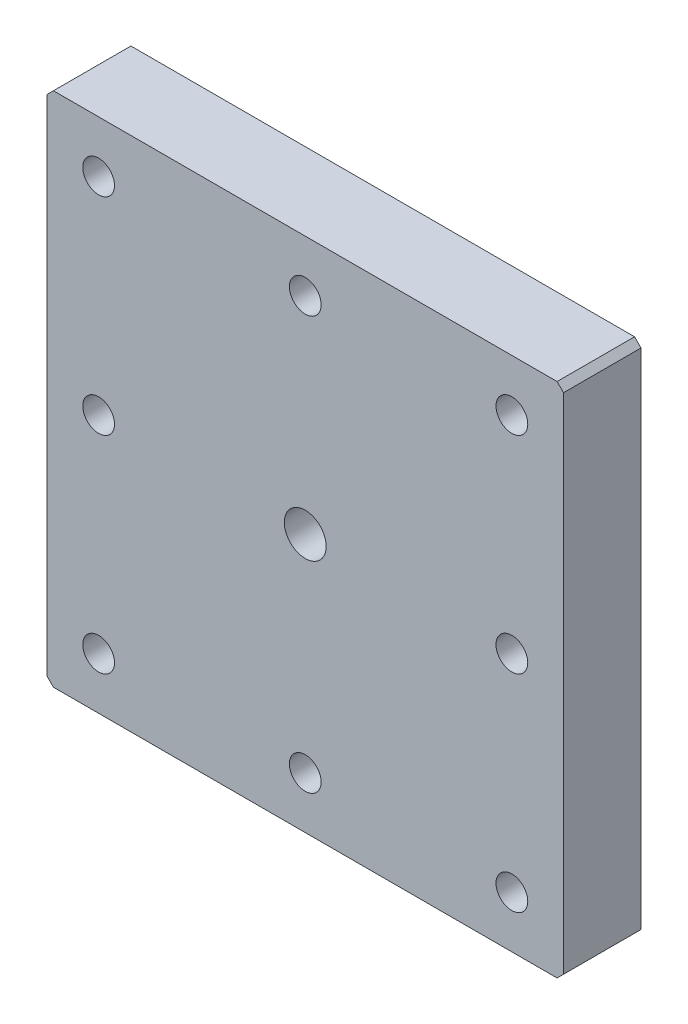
ISO-10303-21;
HEADER;
FILE_DESCRIPTION(('STEP AP214'),'2;1');
FILE_NAME('part.step','',(''),(''),'','','');
FILE_SCHEMA(('AUTOMOTIVE_DESIGN { 1 0 10303 214 1 1 1 1 }'));
ENDSEC;
DATA;
#1=APPLICATION_CONTEXT('core data for automotive mechanical design processes');
#2=APPLICATION_PROTOCOL_DEFINITION('international standard','automotive_design',2000,#1);
#3=PRODUCT_CONTEXT('',#1,'mechanical');
#4=PRODUCT('Part','Part','',(#3));
#5=PRODUCT_RELATED_PRODUCT_CATEGORY('part','',(#4));
#6=PRODUCT_DEFINITION_FORMATION('','',#4);
#7=PRODUCT_DEFINITION_CONTEXT('part definition',#1,'design');
#8=PRODUCT_DEFINITION('design','',#6,#7);
#9=PRODUCT_DEFINITION_SHAPE('','',#8);
#10=(LENGTH_UNIT() NAMED_UNIT(*) SI_UNIT(.MILLI.,.METRE.));
#11=(NAMED_UNIT(*) PLANE_ANGLE_UNIT() SI_UNIT($,.RADIAN.));
#12=(NAMED_UNIT(*) SI_UNIT($,.STERADIAN.) SOLID_ANGLE_UNIT());
#13=UNCERTAINTY_MEASURE_WITH_UNIT(LENGTH_MEASURE(1.E-05),#10,'distance_accuracy_value','');
#14=(GEOMETRIC_REPRESENTATION_CONTEXT(3) GLOBAL_UNCERTAINTY_ASSIGNED_CONTEXT((#13)) GLOBAL_UNIT_ASSIGNED_CONTEXT((#10,
#11,#12)) REPRESENTATION_CONTEXT('',''));
#15=CARTESIAN_POINT('',(0.,0.,0.));
#16=DIRECTION('',(0.,0.,1.));
#17=DIRECTION('',(1.,0.,0.));
#18=AXIS2_PLACEMENT_3D('',#15,#16,#17);
#19=CARTESIAN_POINT('',(20.,20.0000000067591,12.0000000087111));
#20=DIRECTION('',(0.,-1.,0.));
#21=DIRECTION('',(0.,0.,-1.));
#22=AXIS2_PLACEMENT_3D('',#19,#20,#21);
#23=PLANE('',#22);
#24=DIRECTION('',(-1.,0.,0.));
#25=VECTOR('',#24,1.);
#26=CARTESIAN_POINT('',(20.,20.0000000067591,18.0000000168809));
#27=LINE('',#26,#25);
#28=CARTESIAN_POINT('',(19.5,20.0000000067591,18.0000000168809));
#29=VERTEX_POINT('',#28);
#30=CARTESIAN_POINT('',(-19.5,20.0000000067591,18.0000000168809));
#31=VERTEX_POINT('',#30);
#32=EDGE_CURVE('E364',#29,#31,#27,.T.);
#33=ORIENTED_EDGE('',*,*,#32,.F.);
#34=DIRECTION('',(0.,0.,-1.));
#35=VECTOR('',#34,1.);
#36=CARTESIAN_POINT('',(19.5,20.0000000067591,12.0000000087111));
#37=LINE('',#36,#35);
#38=CARTESIAN_POINT('',(19.5,20.0000000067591,12.0000000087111));
#39=VERTEX_POINT('',#38);
#40=EDGE_CURVE('E319',#29,#39,#37,.T.);
#41=ORIENTED_EDGE('',*,*,#40,.T.);
#42=DIRECTION('',(-1.,0.,0.));
#43=VECTOR('',#42,1.);
#44=CARTESIAN_POINT('',(20.,20.0000000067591,12.0000000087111));
#45=LINE('',#44,#43);
#46=CARTESIAN_POINT('',(-19.5,20.0000000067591,12.0000000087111));
#47=VERTEX_POINT('',#46);
#48=EDGE_CURVE('E374',#39,#47,#45,.T.);
#49=ORIENTED_EDGE('',*,*,#48,.T.);
#50=DIRECTION('',(0.,0.,1.));
#51=VECTOR('',#50,1.);
#52=CARTESIAN_POINT('',(-19.5,20.0000000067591,12.0000000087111));
#53=LINE('',#52,#51);
#54=EDGE_CURVE('E317',#47,#31,#53,.T.);
#55=ORIENTED_EDGE('',*,*,#54,.T.);
#56=EDGE_LOOP('',(#33,#41,#49,#55));
#57=FACE_BOUND('',#56,.T.);
#58=ADVANCED_FACE('F16',(#57),#23,.F.);
#59=CARTESIAN_POINT('',(20.,20.0000000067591,18.0000000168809));
#60=DIRECTION('',(0.,0.,-1.));
#61=DIRECTION('',(-1.,0.,0.));
#62=AXIS2_PLACEMENT_3D('',#59,#60,#61);
#63=PLANE('',#62);
#64=CARTESIAN_POINT('',(0.,0.,18.0000000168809));
#65=DIRECTION('',(0.,0.,1.));
#66=DIRECTION('',(1.,0.,0.));
#67=AXIS2_PLACEMENT_3D('',#64,#65,#66);
#68=CIRCLE('',#67,1.621);
#69=CARTESIAN_POINT('',(1.621,0.,18.0000000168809));
#70=VERTEX_POINT('',#69);
#71=EDGE_CURVE('E172',#70,#70,#68,.T.);
#72=ORIENTED_EDGE('',*,*,#71,.F.);
#73=EDGE_LOOP('',(#72));
#74=FACE_BOUND('',#73,.T.);
#75=CARTESIAN_POINT('',(0.,-16.,18.0000000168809));
#76=DIRECTION('',(0.,0.,1.));
#77=DIRECTION('',(1.,0.,0.));
#78=AXIS2_PLACEMENT_3D('',#75,#76,#77);
#79=CIRCLE('',#78,1.2295);
#80=CARTESIAN_POINT('',(1.2295,-16.,18.0000000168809));
#81=VERTEX_POINT('',#80);
#82=EDGE_CURVE('E171',#81,#81,#79,.T.);
#83=ORIENTED_EDGE('',*,*,#82,.F.);
#84=EDGE_LOOP('',(#83));
#85=FACE_BOUND('',#84,.T.);
#86=CARTESIAN_POINT('',(-16.,-16.,18.0000000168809));
#87=DIRECTION('',(0.,0.,1.));
#88=DIRECTION('',(1.,0.,0.));
#89=AXIS2_PLACEMENT_3D('',#86,#87,#88);
#90=CIRCLE('',#89,1.2295);
#91=CARTESIAN_POINT('',(-14.7705,-16.,18.0000000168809));
#92=VERTEX_POINT('',#91);
#93=EDGE_CURVE('E182',#92,#92,#90,.T.);
#94=ORIENTED_EDGE('',*,*,#93,.F.);
#95=EDGE_LOOP('',(#94));
#96=FACE_BOUND('',#95,.T.);
#97=DIRECTION('',(-1.,0.,0.));
#98=VECTOR('',#97,1.);
#99=CARTESIAN_POINT('',(20.,-20.0000000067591,18.0000000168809));
#100=LINE('',#99,#98);
#101=CARTESIAN_POINT('',(19.5,-20.0000000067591,18.0000000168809));
#102=VERTEX_POINT('',#101);
#103=CARTESIAN_POINT('',(-19.5,-20.0000000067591,18.0000000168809));
#104=VERTEX_POINT('',#103);
#105=EDGE_CURVE('E358',#102,#104,#100,.T.);
#106=ORIENTED_EDGE('',*,*,#105,.F.);
#107=DIRECTION('',(0.707106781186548,0.707106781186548,0.));
#108=VECTOR('',#107,1.);
#109=CARTESIAN_POINT('',(20.,-19.5000000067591,18.0000000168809));
#110=LINE('',#109,#108);
#111=CARTESIAN_POINT('',(20.,-19.5000000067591,18.0000000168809));
#112=VERTEX_POINT('',#111);
#113=EDGE_CURVE('E310',#102,#112,#110,.T.);
#114=ORIENTED_EDGE('',*,*,#113,.T.);
#115=DIRECTION('',(0.,-1.,0.));
#116=VECTOR('',#115,1.);
#117=CARTESIAN_POINT('',(20.,20.0000000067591,18.0000000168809));
#118=LINE('',#117,#116);
#119=CARTESIAN_POINT('',(20.,19.5000000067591,18.0000000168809));
#120=VERTEX_POINT('',#119);
#121=EDGE_CURVE('E339',#120,#112,#118,.T.);
#122=ORIENTED_EDGE('',*,*,#121,.F.);
#123=DIRECTION('',(-0.707106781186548,0.707106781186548,0.));
#124=VECTOR('',#123,1.);
#125=CARTESIAN_POINT('',(20.,19.5000000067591,18.0000000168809));
#126=LINE('',#125,#124);
#127=EDGE_CURVE('E39',#120,#29,#126,.T.);
#128=ORIENTED_EDGE('',*,*,#127,.T.);
#129=ORIENTED_EDGE('',*,*,#32,.T.);
#130=DIRECTION('',(0.707106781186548,0.707106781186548,0.));
#131=VECTOR('',#130,1.);
#132=CARTESIAN_POINT('',(-19.5,20.0000000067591,18.0000000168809));
#133=LINE('',#132,#131);
#134=CARTESIAN_POINT('',(-20.,19.5000000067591,18.0000000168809));
#135=VERTEX_POINT('',#134);
#136=EDGE_CURVE('E31',#31,#135,#133,.F.);
#137=ORIENTED_EDGE('',*,*,#136,.T.);
#138=DIRECTION('',(0.,-1.,0.));
#139=VECTOR('',#138,1.);
#140=CARTESIAN_POINT('',(-20.,20.0000000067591,18.0000000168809));
#141=LINE('',#140,#139);
#142=CARTESIAN_POINT('',(-20.,-19.5000000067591,18.0000000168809));
#143=VERTEX_POINT('',#142);
#144=EDGE_CURVE('E328',#135,#143,#141,.T.);
#145=ORIENTED_EDGE('',*,*,#144,.T.);
#146=DIRECTION('',(-0.707106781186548,0.707106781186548,0.));
#147=VECTOR('',#146,1.);
#148=CARTESIAN_POINT('',(-19.5,-20.0000000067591,18.0000000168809));
#149=LINE('',#148,#147);
#150=EDGE_CURVE('E303',#143,#104,#149,.F.);
#151=ORIENTED_EDGE('',*,*,#150,.T.);
#152=EDGE_LOOP('',(#106,#114,#122,#128,#129,#137,#145,#151));
#153=FACE_BOUND('',#152,.T.);
#154=CARTESIAN_POINT('',(16.,-16.,18.0000000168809));
#155=DIRECTION('',(0.,0.,1.));
#156=DIRECTION('',(1.,0.,0.));
#157=AXIS2_PLACEMENT_3D('',#154,#155,#156);
#158=CIRCLE('',#157,1.2295);
#159=CARTESIAN_POINT('',(17.2295,-16.,18.0000000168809));
#160=VERTEX_POINT('',#159);
#161=EDGE_CURVE('E406',#160,#160,#158,.T.);
#162=ORIENTED_EDGE('',*,*,#161,.F.);
#163=EDGE_LOOP('',(#162));
#164=FACE_BOUND('',#163,.T.);
#165=CARTESIAN_POINT('',(-16.,0.,18.0000000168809));
#166=DIRECTION('',(0.,0.,1.));
#167=DIRECTION('',(1.,0.,0.));
#168=AXIS2_PLACEMENT_3D('',#165,#166,#167);
#169=CIRCLE('',#168,1.2295);
#170=CARTESIAN_POINT('',(-14.7705,0.,18.0000000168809));
#171=VERTEX_POINT('',#170);
#172=EDGE_CURVE('E412',#171,#171,#169,.T.);
#173=ORIENTED_EDGE('',*,*,#172,.F.);
#174=EDGE_LOOP('',(#173));
#175=FACE_BOUND('',#174,.T.);
#176=CARTESIAN_POINT('',(16.,0.,18.0000000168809));
#177=DIRECTION('',(0.,0.,1.));
#178=DIRECTION('',(1.,0.,0.));
#179=AXIS2_PLACEMENT_3D('',#176,#177,#178);
#180=CIRCLE('',#179,1.2295);
#181=CARTESIAN_POINT('',(17.2295,0.,18.0000000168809));
#182=VERTEX_POINT('',#181);
#183=EDGE_CURVE('E418',#182,#182,#180,.T.);
#184=ORIENTED_EDGE('',*,*,#183,.F.);
#185=EDGE_LOOP('',(#184));
#186=FACE_BOUND('',#185,.T.);
#187=CARTESIAN_POINT('',(-16.,16.,18.0000000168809));
#188=DIRECTION('',(0.,0.,1.));
#189=DIRECTION('',(1.,0.,0.));
#190=AXIS2_PLACEMENT_3D('',#187,#188,#189);
#191=CIRCLE('',#190,1.2295);
#192=CARTESIAN_POINT('',(-14.7705,16.,18.0000000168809));
#193=VERTEX_POINT('',#192);
#194=EDGE_CURVE('E424',#193,#193,#191,.T.);
#195=ORIENTED_EDGE('',*,*,#194,.F.);
#196=EDGE_LOOP('',(#195));
#197=FACE_BOUND('',#196,.T.);
#198=CARTESIAN_POINT('',(0.,16.,18.0000000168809));
#199=DIRECTION('',(0.,0.,1.));
#200=DIRECTION('',(1.,0.,0.));
#201=AXIS2_PLACEMENT_3D('',#198,#199,#200);
#202=CIRCLE('',#201,1.2295);
#203=CARTESIAN_POINT('',(1.2295,16.,18.0000000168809));
#204=VERTEX_POINT('',#203);
#205=EDGE_CURVE('E430',#204,#204,#202,.T.);
#206=ORIENTED_EDGE('',*,*,#205,.F.);
#207=EDGE_LOOP('',(#206));
#208=FACE_BOUND('',#207,.T.);
#209=CARTESIAN_POINT('',(16.,16.,18.0000000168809));
#210=DIRECTION('',(0.,0.,1.));
#211=DIRECTION('',(1.,0.,0.));
#212=AXIS2_PLACEMENT_3D('',#209,#210,#211);
#213=CIRCLE('',#212,1.2295);
#214=CARTESIAN_POINT('',(17.2295,16.,18.0000000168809));
#215=VERTEX_POINT('',#214);
#216=EDGE_CURVE('E436',#215,#215,#213,.T.);
#217=ORIENTED_EDGE('',*,*,#216,.F.);
#218=EDGE_LOOP('',(#217));
#219=FACE_BOUND('',#218,.T.);
#220=ADVANCED_FACE('F235',(#74,#85,#96,#153,#164,#175,#186,#197,#208,#219),#63,.F.);
#221=CARTESIAN_POINT('',(20.,-20.0000000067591,18.0000000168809));
#222=DIRECTION('',(0.,1.,0.));
#223=DIRECTION('',(0.,0.,1.));
#224=AXIS2_PLACEMENT_3D('',#221,#222,#223);
#225=PLANE('',#224);
#226=DIRECTION('',(-1.,0.,0.));
#227=VECTOR('',#226,1.);
#228=CARTESIAN_POINT('',(20.,-20.0000000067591,12.0000000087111));
#229=LINE('',#228,#227);
#230=CARTESIAN_POINT('',(19.5,-20.0000000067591,12.0000000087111));
#231=VERTEX_POINT('',#230);
#232=CARTESIAN_POINT('',(-19.5,-20.0000000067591,12.0000000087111));
#233=VERTEX_POINT('',#232);
#234=EDGE_CURVE('E360',#231,#233,#229,.T.);
#235=ORIENTED_EDGE('',*,*,#234,.F.);
#236=DIRECTION('',(0.,0.,1.));
#237=VECTOR('',#236,1.);
#238=CARTESIAN_POINT('',(19.5,-20.0000000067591,18.0000000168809));
#239=LINE('',#238,#237);
#240=EDGE_CURVE('E312',#231,#102,#239,.T.);
#241=ORIENTED_EDGE('',*,*,#240,.T.);
#242=ORIENTED_EDGE('',*,*,#105,.T.);
#243=DIRECTION('',(0.,0.,-1.));
#244=VECTOR('',#243,1.);
#245=CARTESIAN_POINT('',(-19.5,-20.0000000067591,18.0000000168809));
#246=LINE('',#245,#244);
#247=EDGE_CURVE('E305',#104,#233,#246,.T.);
#248=ORIENTED_EDGE('',*,*,#247,.T.);
#249=EDGE_LOOP('',(#235,#241,#242,#248));
#250=FACE_BOUND('',#249,.T.);
#251=ADVANCED_FACE('F241',(#250),#225,.F.);
#252=CARTESIAN_POINT('',(20.,-6.36324864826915,12.0000000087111));
#253=DIRECTION('',(0.,0.866025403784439,-0.5));
#254=DIRECTION('',(0.,0.5,0.866025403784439));
#255=AXIS2_PLACEMENT_3D('',#252,#253,#254);
#256=PLANE('',#255);
#257=DIRECTION('',(-1.,0.,0.));
#258=VECTOR('',#257,1.);
#259=CARTESIAN_POINT('',(20.,-9.25,6.99999999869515));
#260=LINE('',#259,#258);
#261=CARTESIAN_POINT('',(7.5,-9.25,6.99999999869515));
#262=VERTEX_POINT('',#261);
#263=CARTESIAN_POINT('',(-20.,-9.25,6.99999999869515));
#264=VERTEX_POINT('',#263);
#265=EDGE_CURVE('E399',#262,#264,#260,.T.);
#266=ORIENTED_EDGE('',*,*,#265,.F.);
#267=DIRECTION('',(0.,-0.5,-0.866025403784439));
#268=VECTOR('',#267,1.);
#269=CARTESIAN_POINT('',(7.5,-6.36324864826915,12.0000000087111));
#270=LINE('',#269,#268);
#271=CARTESIAN_POINT('',(7.5,-6.36324864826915,12.0000000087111));
#272=VERTEX_POINT('',#271);
#273=EDGE_CURVE('E479',#272,#262,#270,.T.);
#274=ORIENTED_EDGE('',*,*,#273,.F.);
#275=DIRECTION('',(-1.,0.,0.));
#276=VECTOR('',#275,1.);
#277=CARTESIAN_POINT('',(20.,-6.36324864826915,12.0000000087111));
#278=LINE('',#277,#276);
#279=CARTESIAN_POINT('',(-20.,-6.36324864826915,12.0000000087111));
#280=VERTEX_POINT('',#279);
#281=EDGE_CURVE('E401',#272,#280,#278,.T.);
#282=ORIENTED_EDGE('',*,*,#281,.T.);
#283=DIRECTION('',(0.,-0.5,-0.866025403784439));
#284=VECTOR('',#283,1.);
#285=CARTESIAN_POINT('',(-20.,-6.36324864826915,12.0000000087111));
#286=LINE('',#285,#284);
#287=EDGE_CURVE('E384',#280,#264,#286,.T.);
#288=ORIENTED_EDGE('',*,*,#287,.T.);
#289=EDGE_LOOP('',(#266,#274,#282,#288));
#290=FACE_BOUND('',#289,.T.);
#291=ADVANCED_FACE('F477',(#290),#256,.F.);
#292=CARTESIAN_POINT('',(20.,-9.25,6.99999999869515));
#293=DIRECTION('',(0.,1.,0.));
#294=DIRECTION('',(0.,0.,1.));
#295=AXIS2_PLACEMENT_3D('',#292,#293,#294);
#296=PLANE('',#295);
#297=DIRECTION('',(-1.,0.,0.));
#298=VECTOR('',#297,1.);
#299=CARTESIAN_POINT('',(20.,-9.25,6.49999999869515));
#300=LINE('',#299,#298);
#301=CARTESIAN_POINT('',(7.5,-9.25,6.49999999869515));
#302=VERTEX_POINT('',#301);
#303=CARTESIAN_POINT('',(-20.,-9.25,6.49999999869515));
#304=VERTEX_POINT('',#303);
#305=EDGE_CURVE('E397',#302,#304,#300,.T.);
#306=ORIENTED_EDGE('',*,*,#305,.F.);
#307=DIRECTION('',(0.,0.,-1.));
#308=VECTOR('',#307,1.);
#309=CARTESIAN_POINT('',(7.5,-9.25,6.99999999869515));
#310=LINE('',#309,#308);
#311=EDGE_CURVE('E382',#262,#302,#310,.T.);
#312=ORIENTED_EDGE('',*,*,#311,.F.);
#313=ORIENTED_EDGE('',*,*,#265,.T.);
#314=DIRECTION('',(0.,0.,-1.));
#315=VECTOR('',#314,1.);
#316=CARTESIAN_POINT('',(-20.,-9.25,6.99999999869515));
#317=LINE('',#316,#315);
#318=EDGE_CURVE('E387',#264,#304,#317,.T.);
#319=ORIENTED_EDGE('',*,*,#318,.T.);
#320=EDGE_LOOP('',(#306,#312,#313,#319));
#321=FACE_BOUND('',#320,.T.);
#322=ADVANCED_FACE('F498',(#321),#296,.F.);
#323=CARTESIAN_POINT('',(20.,-9.25,6.49999999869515));
#324=DIRECTION('',(0.,0.,1.));
#325=DIRECTION('',(0.,-1.,0.));
#326=AXIS2_PLACEMENT_3D('',#323,#324,#325);
#327=PLANE('',#326);
#328=DIRECTION('',(-1.,0.,0.));
#329=VECTOR('',#328,1.);
#330=CARTESIAN_POINT('',(0.,-2.5,6.49999999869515));
#331=LINE('',#330,#329);
#332=CARTESIAN_POINT('',(0.,-2.5,6.49999999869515));
#333=VERTEX_POINT('',#332);
#334=CARTESIAN_POINT('',(-16.,-2.5,6.49999999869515));
#335=VERTEX_POINT('',#334);
#336=EDGE_CURVE('E518',#333,#335,#331,.T.);
#337=ORIENTED_EDGE('',*,*,#336,.F.);
#338=CARTESIAN_POINT('',(0.,0.,6.49999999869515));
#339=DIRECTION('',(0.,0.,-1.));
#340=DIRECTION('',(0.,1.,0.));
#341=AXIS2_PLACEMENT_3D('',#338,#339,#340);
#342=CIRCLE('',#341,2.5);
#343=CARTESIAN_POINT('',(0.,2.5,6.49999999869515));
#344=VERTEX_POINT('',#343);
#345=EDGE_CURVE('E199',#344,#333,#342,.T.);
#346=ORIENTED_EDGE('',*,*,#345,.F.);
#347=DIRECTION('',(1.,0.,0.));
#348=VECTOR('',#347,1.);
#349=CARTESIAN_POINT('',(0.,2.5,6.49999999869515));
#350=LINE('',#349,#348);
#351=CARTESIAN_POINT('',(-16.,2.5,6.49999999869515));
#352=VERTEX_POINT('',#351);
#353=EDGE_CURVE('E512',#352,#344,#350,.T.);
#354=ORIENTED_EDGE('',*,*,#353,.F.);
#355=CARTESIAN_POINT('',(-16.,0.,6.49999999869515));
#356=DIRECTION('',(0.,0.,-1.));
#357=DIRECTION('',(0.,1.,0.));
#358=AXIS2_PLACEMENT_3D('',#355,#356,#357);
#359=CIRCLE('',#358,2.5);
#360=EDGE_CURVE('E515',#335,#352,#359,.T.);
#361=ORIENTED_EDGE('',*,*,#360,.F.);
#362=EDGE_LOOP('',(#337,#346,#354,#361));
#363=FACE_BOUND('',#362,.T.);
#364=DIRECTION('',(-1.,0.,0.));
#365=VECTOR('',#364,1.);
#366=CARTESIAN_POINT('',(20.,9.25,6.49999999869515));
#367=LINE('',#366,#365);
#368=CARTESIAN_POINT('',(7.5,9.25,6.49999999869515));
#369=VERTEX_POINT('',#368);
#370=CARTESIAN_POINT('',(-20.,9.25,6.49999999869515));
#371=VERTEX_POINT('',#370);
#372=EDGE_CURVE('E395',#369,#371,#367,.T.);
#373=ORIENTED_EDGE('',*,*,#372,.F.);
#374=DIRECTION('',(0.,1.,0.));
#375=VECTOR('',#374,1.);
#376=CARTESIAN_POINT('',(7.5,-9.25,6.49999999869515));
#377=LINE('',#376,#375);
#378=EDGE_CURVE('E488',#302,#369,#377,.T.);
#379=ORIENTED_EDGE('',*,*,#378,.F.);
#380=ORIENTED_EDGE('',*,*,#305,.T.);
#381=DIRECTION('',(0.,1.,0.));
#382=VECTOR('',#381,1.);
#383=CARTESIAN_POINT('',(-20.,-9.25,6.49999999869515));
#384=LINE('',#383,#382);
#385=EDGE_CURVE('E390',#304,#371,#384,.T.);
#386=ORIENTED_EDGE('',*,*,#385,.T.);
#387=EDGE_LOOP('',(#373,#379,#380,#386));
#388=FACE_BOUND('',#387,.T.);
#389=ADVANCED_FACE('F494',(#363,#388),#327,.F.);
#390=CARTESIAN_POINT('',(20.,9.25,6.49999999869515));
#391=DIRECTION('',(0.,-0.866025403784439,-0.5));
#392=DIRECTION('',(0.,0.5,-0.866025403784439));
#393=AXIS2_PLACEMENT_3D('',#390,#391,#392);
#394=PLANE('',#393);
#395=DIRECTION('',(-1.,0.,0.));
#396=VECTOR('',#395,1.);
#397=CARTESIAN_POINT('',(20.,6.07457351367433,12.0000000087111));
#398=LINE('',#397,#396);
#399=CARTESIAN_POINT('',(7.5,6.07457351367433,12.0000000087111));
#400=VERTEX_POINT('',#399);
#401=CARTESIAN_POINT('',(-20.,6.07457351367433,12.0000000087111));
#402=VERTEX_POINT('',#401);
#403=EDGE_CURVE('E337',#400,#402,#398,.T.);
#404=ORIENTED_EDGE('',*,*,#403,.F.);
#405=DIRECTION('',(0.,-0.5,0.866025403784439));
#406=VECTOR('',#405,1.);
#407=CARTESIAN_POINT('',(7.5,9.25,6.49999999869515));
#408=LINE('',#407,#406);
#409=EDGE_CURVE('E483',#369,#400,#408,.T.);
#410=ORIENTED_EDGE('',*,*,#409,.F.);
#411=ORIENTED_EDGE('',*,*,#372,.T.);
#412=DIRECTION('',(0.,-0.5,0.866025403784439));
#413=VECTOR('',#412,1.);
#414=CARTESIAN_POINT('',(-20.,9.25,6.49999999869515));
#415=LINE('',#414,#413);
#416=EDGE_CURVE('E340',#371,#402,#415,.T.);
#417=ORIENTED_EDGE('',*,*,#416,.T.);
#418=EDGE_LOOP('',(#404,#410,#411,#417));
#419=FACE_BOUND('',#418,.T.);
#420=ADVANCED_FACE('F492',(#419),#394,.F.);
#421=CARTESIAN_POINT('',(20.,6.07457351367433,12.0000000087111));
#422=DIRECTION('',(0.,0.,1.));
#423=DIRECTION('',(0.,-1.,0.));
#424=AXIS2_PLACEMENT_3D('',#421,#422,#423);
#425=PLANE('',#424);
#426=DIRECTION('',(0.,1.,0.));
#427=VECTOR('',#426,1.);
#428=CARTESIAN_POINT('',(20.,-20.0000000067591,12.0000000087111));
#429=LINE('',#428,#427);
#430=CARTESIAN_POINT('',(20.,-19.5000000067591,12.0000000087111));
#431=VERTEX_POINT('',#430);
#432=CARTESIAN_POINT('',(20.,19.5000000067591,12.0000000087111));
#433=VERTEX_POINT('',#432);
#434=EDGE_CURVE('E371',#431,#433,#429,.T.);
#435=ORIENTED_EDGE('',*,*,#434,.F.);
#436=DIRECTION('',(-0.707106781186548,-0.707106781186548,0.));
#437=VECTOR('',#436,1.);
#438=CARTESIAN_POINT('',(20.,-19.5000000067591,12.0000000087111));
#439=LINE('',#438,#437);
#440=EDGE_CURVE('E353',#431,#231,#439,.T.);
#441=ORIENTED_EDGE('',*,*,#440,.T.);
#442=ORIENTED_EDGE('',*,*,#234,.T.);
#443=DIRECTION('',(0.707106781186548,-0.707106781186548,0.));
#444=VECTOR('',#443,1.);
#445=CARTESIAN_POINT('',(-19.5,-20.0000000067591,12.0000000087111));
#446=LINE('',#445,#444);
#447=CARTESIAN_POINT('',(-20.,-19.5000000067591,12.0000000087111));
#448=VERTEX_POINT('',#447);
#449=EDGE_CURVE('E342',#233,#448,#446,.F.);
#450=ORIENTED_EDGE('',*,*,#449,.T.);
#451=DIRECTION('',(0.,1.,0.));
#452=VECTOR('',#451,1.);
#453=CARTESIAN_POINT('',(-20.,-20.0000000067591,12.0000000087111));
#454=LINE('',#453,#452);
#455=EDGE_CURVE('E381',#448,#280,#454,.T.);
#456=ORIENTED_EDGE('',*,*,#455,.T.);
#457=ORIENTED_EDGE('',*,*,#281,.F.);
#458=DIRECTION('',(0.,-1.,0.));
#459=VECTOR('',#458,1.);
#460=CARTESIAN_POINT('',(7.5,6.07457351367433,12.0000000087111));
#461=LINE('',#460,#459);
#462=EDGE_CURVE('E480',#400,#272,#461,.T.);
#463=ORIENTED_EDGE('',*,*,#462,.F.);
#464=ORIENTED_EDGE('',*,*,#403,.T.);
#465=DIRECTION('',(0.,1.,0.));
#466=VECTOR('',#465,1.);
#467=CARTESIAN_POINT('',(-20.,6.07457351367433,12.0000000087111));
#468=LINE('',#467,#466);
#469=CARTESIAN_POINT('',(-20.,19.5000000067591,12.0000000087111));
#470=VERTEX_POINT('',#469);
#471=EDGE_CURVE('E327',#402,#470,#468,.T.);
#472=ORIENTED_EDGE('',*,*,#471,.T.);
#473=DIRECTION('',(-0.707106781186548,-0.707106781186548,0.));
#474=VECTOR('',#473,1.);
#475=CARTESIAN_POINT('',(-19.5,20.0000000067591,12.0000000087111));
#476=LINE('',#475,#474);
#477=EDGE_CURVE('E334',#470,#47,#476,.F.);
#478=ORIENTED_EDGE('',*,*,#477,.T.);
#479=ORIENTED_EDGE('',*,*,#48,.F.);
#480=DIRECTION('',(0.707106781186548,-0.707106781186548,0.));
#481=VECTOR('',#480,1.);
#482=CARTESIAN_POINT('',(20.,19.5000000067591,12.0000000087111));
#483=LINE('',#482,#481);
#484=EDGE_CURVE('E345',#39,#433,#483,.T.);
#485=ORIENTED_EDGE('',*,*,#484,.T.);
#486=EDGE_LOOP('',(#435,#441,#442,#450,#456,#457,#463,#464,#472,#478,#479,#485));
#487=FACE_BOUND('',#486,.T.);
#488=ADVANCED_FACE('F332',(#487),#425,.F.);
#489=CARTESIAN_POINT('',(20.,0.,0.));
#490=DIRECTION('',(1.,0.,0.));
#491=DIRECTION('',(0.,0.,-1.));
#492=AXIS2_PLACEMENT_3D('',#489,#490,#491);
#493=PLANE('',#492);
#494=ORIENTED_EDGE('',*,*,#121,.T.);
#495=DIRECTION('',(0.,0.,-1.));
#496=VECTOR('',#495,1.);
#497=CARTESIAN_POINT('',(20.,-19.5000000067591,12.0000000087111));
#498=LINE('',#497,#496);
#499=EDGE_CURVE('E343',#112,#431,#498,.T.);
#500=ORIENTED_EDGE('',*,*,#499,.T.);
#501=ORIENTED_EDGE('',*,*,#434,.T.);
#502=DIRECTION('',(0.,0.,1.));
#503=VECTOR('',#502,1.);
#504=CARTESIAN_POINT('',(20.,19.5000000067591,18.0000000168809));
#505=LINE('',#504,#503);
#506=EDGE_CURVE('E348',#433,#120,#505,.T.);
#507=ORIENTED_EDGE('',*,*,#506,.T.);
#508=EDGE_LOOP('',(#494,#500,#501,#507));
#509=FACE_BOUND('',#508,.T.);
#510=ADVANCED_FACE('F369',(#509),#493,.T.);
#511=CARTESIAN_POINT('',(-20.,0.,0.));
#512=DIRECTION('',(1.,0.,0.));
#513=DIRECTION('',(0.,0.,-1.));
#514=AXIS2_PLACEMENT_3D('',#511,#512,#513);
#515=PLANE('',#514);
#516=ORIENTED_EDGE('',*,*,#455,.F.);
#517=DIRECTION('',(0.,0.,1.));
#518=VECTOR('',#517,1.);
#519=CARTESIAN_POINT('',(-20.,-19.5000000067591,0.));
#520=LINE('',#519,#518);
#521=EDGE_CURVE('E11',#448,#143,#520,.T.);
#522=ORIENTED_EDGE('',*,*,#521,.T.);
#523=ORIENTED_EDGE('',*,*,#144,.F.);
#524=DIRECTION('',(0.,0.,-1.));
#525=VECTOR('',#524,1.);
#526=CARTESIAN_POINT('',(-20.,19.5000000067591,0.));
#527=LINE('',#526,#525);
#528=EDGE_CURVE('E24',#135,#470,#527,.T.);
#529=ORIENTED_EDGE('',*,*,#528,.T.);
#530=ORIENTED_EDGE('',*,*,#471,.F.);
#531=ORIENTED_EDGE('',*,*,#416,.F.);
#532=ORIENTED_EDGE('',*,*,#385,.F.);
#533=ORIENTED_EDGE('',*,*,#318,.F.);
#534=ORIENTED_EDGE('',*,*,#287,.F.);
#535=EDGE_LOOP('',(#516,#522,#523,#529,#530,#531,#532,#533,#534));
#536=FACE_BOUND('',#535,.T.);
#537=ADVANCED_FACE('F325',(#536),#515,.F.);
#538=CARTESIAN_POINT('',(7.5,0.,0.));
#539=DIRECTION('',(-1.,0.,0.));
#540=DIRECTION('',(0.,0.,1.));
#541=AXIS2_PLACEMENT_3D('',#538,#539,#540);
#542=PLANE('',#541);
#543=CARTESIAN_POINT('',(7.5,0.,8.69999999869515));
#544=DIRECTION('',(1.,0.,0.));
#545=DIRECTION('',(0.,0.,-1.));
#546=AXIS2_PLACEMENT_3D('',#543,#544,#545);
#547=CIRCLE('',#546,2.);
#548=CARTESIAN_POINT('',(7.5,0.,6.69999999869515));
#549=VERTEX_POINT('',#548);
#550=EDGE_CURVE('E188',#549,#549,#547,.T.);
#551=ORIENTED_EDGE('',*,*,#550,.F.);
#552=EDGE_LOOP('',(#551));
#553=FACE_BOUND('',#552,.T.);
#554=ORIENTED_EDGE('',*,*,#378,.T.);
#555=ORIENTED_EDGE('',*,*,#409,.T.);
#556=ORIENTED_EDGE('',*,*,#462,.T.);
#557=ORIENTED_EDGE('',*,*,#273,.T.);
#558=ORIENTED_EDGE('',*,*,#311,.T.);
#559=EDGE_LOOP('',(#554,#555,#556,#557,#558));
#560=FACE_BOUND('',#559,.T.);
#561=ADVANCED_FACE('F486',(#553,#560),#542,.F.);
#562=CARTESIAN_POINT('',(0.,0.,10.9999999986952));
#563=DIRECTION('',(0.,0.,-1.));
#564=DIRECTION('',(0.,1.,0.));
#565=AXIS2_PLACEMENT_3D('',#562,#563,#564);
#566=CYLINDRICAL_SURFACE('',#565,2.5);
#567=CARTESIAN_POINT('',(2.5,0.,6.69999999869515));
#568=CARTESIAN_POINT('',(2.49999264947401,-0.0959968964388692,6.70000757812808));
#569=CARTESIAN_POINT('',(2.49441368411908,-0.192133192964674,6.70696942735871));
#570=CARTESIAN_POINT('',(2.47259269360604,-0.381319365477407,6.73434993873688));
#571=CARTESIAN_POINT('',(2.45632708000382,-0.474361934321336,6.75479836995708));
#572=CARTESIAN_POINT('',(2.4146672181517,-0.654094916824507,6.80767827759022));
#573=CARTESIAN_POINT('',(2.38933120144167,-0.740821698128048,6.84003335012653));
#574=CARTESIAN_POINT('',(2.33136010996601,-0.906926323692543,6.91511734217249));
#575=CARTESIAN_POINT('',(2.29872501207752,-0.986304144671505,6.95784629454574));
#576=CARTESIAN_POINT('',(2.21575664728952,-1.16318123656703,7.06862836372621));
#577=CARTESIAN_POINT('',(2.16321748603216,-1.25736767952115,7.14031891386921));
#578=CARTESIAN_POINT('',(2.05292192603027,-1.43041367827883,7.29727806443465));
#579=CARTESIAN_POINT('',(1.99515072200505,-1.50922761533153,7.38258575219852));
#580=CARTESIAN_POINT('',(1.87856001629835,-1.6521591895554,7.56677398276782));
#581=CARTESIAN_POINT('',(1.81973830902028,-1.71602638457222,7.66584677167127));
#582=CARTESIAN_POINT('',(1.7088210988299,-1.82646834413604,7.87653878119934));
#583=CARTESIAN_POINT('',(1.65670347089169,-1.87310099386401,7.98811433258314));
#584=CARTESIAN_POINT('',(1.58835652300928,-1.93086043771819,8.17387895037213));
#585=CARTESIAN_POINT('',(1.56628727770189,-1.94865475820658,8.24381173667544));
#586=CARTESIAN_POINT('',(1.53069889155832,-1.97673396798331,8.38721268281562));
#587=CARTESIAN_POINT('',(1.5171587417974,-1.98703731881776,8.46067167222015));
#588=CARTESIAN_POINT('',(1.50084234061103,-1.99939840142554,8.61019251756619));
#589=CARTESIAN_POINT('',(1.49816096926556,-2.00138345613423,8.68627148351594));
#590=CARTESIAN_POINT('',(1.5043996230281,-1.99669481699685,8.83770489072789));
#591=CARTESIAN_POINT('',(1.51332946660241,-1.99001379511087,8.91305866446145));
#592=CARTESIAN_POINT('',(1.5432072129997,-1.9669530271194,9.07222230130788));
#593=CARTESIAN_POINT('',(1.56581842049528,-1.94921808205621,9.15550800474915));
#594=CARTESIAN_POINT('',(1.61997459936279,-1.90444547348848,9.31653555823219));
#595=CARTESIAN_POINT('',(1.65154598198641,-1.87738025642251,9.39426015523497));
#596=CARTESIAN_POINT('',(1.73656116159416,-1.79974102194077,9.58066210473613));
#597=CARTESIAN_POINT('',(1.79313372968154,-1.74414886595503,9.68580269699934));
#598=CARTESIAN_POINT('',(1.90913780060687,-1.61638467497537,9.88371667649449));
#599=CARTESIAN_POINT('',(1.96857337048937,-1.54418846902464,9.97647171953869));
#600=CARTESIAN_POINT('',(2.08612751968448,-1.38145818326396,10.1512747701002));
#601=CARTESIAN_POINT('',(2.14416889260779,-1.29048701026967,10.2329719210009));
#602=CARTESIAN_POINT('',(2.25171871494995,-1.09198491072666,10.3800994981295));
#603=CARTESIAN_POINT('',(2.30124991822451,-0.984499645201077,10.4455735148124));
#604=CARTESIAN_POINT('',(2.37424585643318,-0.787777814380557,10.540562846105));
#605=CARTESIAN_POINT('',(2.40111071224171,-0.702177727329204,10.5750045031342));
#606=CARTESIAN_POINT('',(2.44597564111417,-0.524913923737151,10.6321264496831));
#607=CARTESIAN_POINT('',(2.46398239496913,-0.433254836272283,10.6548156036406));
#608=CARTESIAN_POINT('',(2.48970335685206,-0.245713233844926,10.6871385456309));
#609=CARTESIAN_POINT('',(2.49736378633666,-0.149811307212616,10.6967041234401));
#610=CARTESIAN_POINT('',(2.50148682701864,0.0426080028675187,10.7018590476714));
#611=CARTESIAN_POINT('',(2.49795152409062,0.139125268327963,10.6974509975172));
#612=CARTESIAN_POINT('',(2.48076858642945,0.321746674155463,10.6759171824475));
#613=CARTESIAN_POINT('',(2.46796352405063,0.408060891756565,10.6598508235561));
#614=CARTESIAN_POINT('',(2.43417513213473,0.576335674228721,10.6171278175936));
#615=CARTESIAN_POINT('',(2.41318937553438,0.658294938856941,10.5904680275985));
#616=CARTESIAN_POINT('',(2.36289849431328,0.82123587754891,10.5258496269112));
#617=CARTESIAN_POINT('',(2.33315912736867,0.901843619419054,10.4872942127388));
#618=CARTESIAN_POINT('',(2.26783622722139,1.05541000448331,10.4011378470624));
#619=CARTESIAN_POINT('',(2.23225240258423,1.12836826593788,10.3535364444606));
#620=CARTESIAN_POINT('',(2.14993687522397,1.27925237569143,10.2407756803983));
#621=CARTESIAN_POINT('',(2.1023696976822,1.35550718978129,10.1739983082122));
#622=CARTESIAN_POINT('',(2.00443497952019,1.4965368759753,10.0306130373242));
#623=CARTESIAN_POINT('',(1.95405970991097,1.56127777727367,9.95397716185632));
#624=CARTESIAN_POINT('',(1.87374135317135,1.65568487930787,9.82356555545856));
#625=CARTESIAN_POINT('',(1.84354743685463,1.68913741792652,9.77263940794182));
#626=CARTESIAN_POINT('',(1.78435415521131,1.75155001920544,9.66737773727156));
#627=CARTESIAN_POINT('',(1.75535542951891,1.78050769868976,9.61304042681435));
#628=CARTESIAN_POINT('',(1.69983828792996,1.83358089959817,9.50112515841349));
#629=CARTESIAN_POINT('',(1.67331090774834,1.85771431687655,9.44356023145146));
#630=CARTESIAN_POINT('',(1.62410209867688,1.90088481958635,9.32499102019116));
#631=CARTESIAN_POINT('',(1.60141789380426,1.9199255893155,9.26398926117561));
#632=CARTESIAN_POINT('',(1.56019420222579,1.95360165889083,9.13391327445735));
#633=CARTESIAN_POINT('',(1.54209716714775,1.96779559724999,9.0645773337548));
#634=CARTESIAN_POINT('',(1.5149337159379,1.98878905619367,8.9231623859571));
#635=CARTESIAN_POINT('',(1.50584452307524,1.99560723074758,8.85109077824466));
#636=CARTESIAN_POINT('',(1.49824736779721,2.00132058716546,8.70565129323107));
#637=CARTESIAN_POINT('',(1.49979625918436,2.0001731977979,8.63227854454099));
#638=CARTESIAN_POINT('',(1.51330771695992,1.98996519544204,8.48701580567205));
#639=CARTESIAN_POINT('',(1.52528679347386,1.98089203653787,8.41512835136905));
#640=CARTESIAN_POINT('',(1.56207076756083,1.95207745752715,8.25539322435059));
#641=CARTESIAN_POINT('',(1.58949258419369,1.93009230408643,8.16857691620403));
#642=CARTESIAN_POINT('',(1.65288907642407,1.87608177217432,8.00136652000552));
#643=CARTESIAN_POINT('',(1.68888887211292,1.84402681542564,7.92099223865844));
#644=CARTESIAN_POINT('',(1.75491158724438,1.78094746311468,7.787822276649));
#645=CARTESIAN_POINT('',(1.78388907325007,1.7520236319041,7.73348081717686));
#646=CARTESIAN_POINT('',(1.84307948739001,1.68964733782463,7.62816176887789));
#647=CARTESIAN_POINT('',(1.87329286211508,1.65619322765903,7.577185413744));
#648=CARTESIAN_POINT('',(1.96437997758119,1.54918435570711,7.42922059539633));
#649=CARTESIAN_POINT('',(2.02569808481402,1.4689854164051,7.33720131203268));
#650=CARTESIAN_POINT('',(2.14418278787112,1.29001718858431,7.16661053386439));
#651=CARTESIAN_POINT('',(2.201284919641,1.19101966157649,7.08822977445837));
#652=CARTESIAN_POINT('',(2.27874650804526,1.02998399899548,6.98442326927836));
#653=CARTESIAN_POINT('',(2.30318868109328,0.974255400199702,6.95213155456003));
#654=CARTESIAN_POINT('',(2.34866115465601,0.85885482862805,6.89263189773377));
#655=CARTESIAN_POINT('',(2.36969354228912,0.799185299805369,6.86542084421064));
#656=CARTESIAN_POINT('',(2.41420905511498,0.655037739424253,6.80821993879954));
#657=CARTESIAN_POINT('',(2.43602892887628,0.569110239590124,6.78051732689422));
#658=CARTESIAN_POINT('',(2.47058864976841,0.392713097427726,6.73684232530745));
#659=CARTESIAN_POINT('',(2.48335227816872,0.302256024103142,6.72083920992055));
#660=CARTESIAN_POINT('',(2.49405378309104,0.175880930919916,6.70743697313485));
#661=CARTESIAN_POINT('',(2.49627918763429,0.140808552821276,6.70465261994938));
#662=CARTESIAN_POINT('',(2.499253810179,0.0704970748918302,6.70093253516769));
#663=CARTESIAN_POINT('',(2.50000269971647,0.0352579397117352,6.69999721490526));
#664=CARTESIAN_POINT('',(2.5,0.,6.69999999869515));
#665=B_SPLINE_CURVE_WITH_KNOTS('',3,(#567,#568,#569,#570,#571,#572,#573,#574,#575,#576,#577,
#578,#579,#580,#581,#582,#583,#584,#585,#586,#587,#588,#589,#590,#591,#592,#593,#594,#595,#596,
#597,#598,#599,#600,#601,#602,#603,#604,#605,#606,#607,#608,#609,#610,#611,#612,#613,#614,#615,
#616,#617,#618,#619,#620,#621,#622,#623,#624,#625,#626,#627,#628,#629,#630,#631,#632,#633,#634,
#635,#636,#637,#638,#639,#640,#641,#642,#643,#644,#645,#646,#647,#648,#649,#650,#651,#652,#653,
#654,#655,#656,#657,#658,#659,#660,#661,#662,#663,#664),.UNSPECIFIED.,.T.,.F.,(4,2,2,2,2,2,2,2,
2,2,2,2,2,2,2,2,2,2,2,2,2,2,2,2,2,2,2,2,2,2,2,2,2,2,2,2,2,2,2,2,2,2,2,2,2,2,2,2,4),(0.,
0.287836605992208,0.576310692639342,0.862965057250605,1.14962032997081,1.53607888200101,
1.92366738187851,2.31734741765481,2.70969292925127,2.9353448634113,3.1604387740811,
3.38749528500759,3.61474392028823,3.87758630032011,4.14121163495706,4.53425748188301,
4.92787915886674,5.33198173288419,5.73498644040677,6.02213978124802,6.30907621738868,
6.59749843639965,6.88586692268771,7.15087004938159,7.41595185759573,7.69742753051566,
7.9789172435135,8.31365537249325,8.64936529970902,8.85316560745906,9.05707360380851,
9.26021055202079,9.46320013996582,9.68152133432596,9.89928907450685,10.1182215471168,
10.3375012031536,10.616933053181,10.8971934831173,11.1010640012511,11.3050088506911,
11.7129165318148,12.1261363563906,12.3324811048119,12.5386990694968,12.8161540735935,
13.0928777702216,13.1985714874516,13.3042887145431),.UNSPECIFIED.);
#666=CARTESIAN_POINT('',(2.5,0.,6.69999999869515));
#667=VERTEX_POINT('',#666);
#668=EDGE_CURVE('E191',#667,#667,#665,.T.);
#669=ORIENTED_EDGE('',*,*,#668,.F.);
#670=EDGE_LOOP('',(#669));
#671=FACE_BOUND('',#670,.T.);
#672=ORIENTED_EDGE('',*,*,#345,.T.);
#673=DIRECTION('',(0.,0.,-1.));
#674=VECTOR('',#673,1.);
#675=CARTESIAN_POINT('',(0.,-2.5,10.9999999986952));
#676=LINE('',#675,#674);
#677=CARTESIAN_POINT('',(0.,-2.5,10.9999999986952));
#678=VERTEX_POINT('',#677);
#679=EDGE_CURVE('E503',#678,#333,#676,.T.);
#680=ORIENTED_EDGE('',*,*,#679,.F.);
#681=CARTESIAN_POINT('',(0.,0.,10.9999999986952));
#682=DIRECTION('',(0.,0.,-1.));
#683=DIRECTION('',(0.,1.,0.));
#684=AXIS2_PLACEMENT_3D('',#681,#682,#683);
#685=CIRCLE('',#684,2.5);
#686=CARTESIAN_POINT('',(0.,2.5,10.9999999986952));
#687=VERTEX_POINT('',#686);
#688=EDGE_CURVE('E200',#687,#678,#685,.T.);
#689=ORIENTED_EDGE('',*,*,#688,.F.);
#690=DIRECTION('',(0.,0.,-1.));
#691=VECTOR('',#690,1.);
#692=CARTESIAN_POINT('',(0.,2.5,10.9999999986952));
#693=LINE('',#692,#691);
#694=EDGE_CURVE('E502',#687,#344,#693,.T.);
#695=ORIENTED_EDGE('',*,*,#694,.T.);
#696=EDGE_LOOP('',(#672,#680,#689,#695));
#697=FACE_BOUND('',#696,.T.);
#698=ADVANCED_FACE('F535',(#671,#697),#566,.F.);
#699=CARTESIAN_POINT('',(0.,2.5,10.9999999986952));
#700=DIRECTION('',(0.,1.,0.));
#701=DIRECTION('',(0.,0.,1.));
#702=AXIS2_PLACEMENT_3D('',#699,#700,#701);
#703=PLANE('',#702);
#704=ORIENTED_EDGE('',*,*,#353,.T.);
#705=ORIENTED_EDGE('',*,*,#694,.F.);
#706=DIRECTION('',(1.,0.,0.));
#707=VECTOR('',#706,1.);
#708=CARTESIAN_POINT('',(0.,2.5,10.9999999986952));
#709=LINE('',#708,#707);
#710=CARTESIAN_POINT('',(-16.,2.5,10.9999999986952));
#711=VERTEX_POINT('',#710);
#712=EDGE_CURVE('E507',#711,#687,#709,.T.);
#713=ORIENTED_EDGE('',*,*,#712,.F.);
#714=DIRECTION('',(0.,0.,-1.));
#715=VECTOR('',#714,1.);
#716=CARTESIAN_POINT('',(-16.,2.5,10.9999999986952));
#717=LINE('',#716,#715);
#718=EDGE_CURVE('E509',#711,#352,#717,.T.);
#719=ORIENTED_EDGE('',*,*,#718,.T.);
#720=EDGE_LOOP('',(#704,#705,#713,#719));
#721=FACE_BOUND('',#720,.T.);
#722=ADVANCED_FACE('F545',(#721),#703,.F.);
#723=CARTESIAN_POINT('',(-16.,0.,10.9999999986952));
#724=DIRECTION('',(0.,0.,-1.));
#725=DIRECTION('',(0.,1.,0.));
#726=AXIS2_PLACEMENT_3D('',#723,#724,#725);
#727=CYLINDRICAL_SURFACE('',#726,2.5);
#728=ORIENTED_EDGE('',*,*,#360,.T.);
#729=ORIENTED_EDGE('',*,*,#718,.F.);
#730=CARTESIAN_POINT('',(-16.,0.,10.9999999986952));
#731=DIRECTION('',(0.,0.,-1.));
#732=DIRECTION('',(0.,1.,0.));
#733=AXIS2_PLACEMENT_3D('',#730,#731,#732);
#734=CIRCLE('',#733,2.5);
#735=CARTESIAN_POINT('',(-16.,-2.5,10.9999999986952));
#736=VERTEX_POINT('',#735);
#737=EDGE_CURVE('E524',#736,#711,#734,.T.);
#738=ORIENTED_EDGE('',*,*,#737,.F.);
#739=DIRECTION('',(0.,0.,-1.));
#740=VECTOR('',#739,1.);
#741=CARTESIAN_POINT('',(-16.,-2.5,10.9999999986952));
#742=LINE('',#741,#740);
#743=EDGE_CURVE('E506',#736,#335,#742,.T.);
#744=ORIENTED_EDGE('',*,*,#743,.T.);
#745=EDGE_LOOP('',(#728,#729,#738,#744));
#746=FACE_BOUND('',#745,.T.);
#747=ADVANCED_FACE('F543',(#746),#727,.F.);
#748=CARTESIAN_POINT('',(0.,-2.5,10.9999999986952));
#749=DIRECTION('',(0.,-1.,0.));
#750=DIRECTION('',(0.,0.,-1.));
#751=AXIS2_PLACEMENT_3D('',#748,#749,#750);
#752=PLANE('',#751);
#753=ORIENTED_EDGE('',*,*,#336,.T.);
#754=ORIENTED_EDGE('',*,*,#743,.F.);
#755=DIRECTION('',(-1.,0.,0.));
#756=VECTOR('',#755,1.);
#757=CARTESIAN_POINT('',(0.,-2.5,10.9999999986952));
#758=LINE('',#757,#756);
#759=EDGE_CURVE('E526',#678,#736,#758,.T.);
#760=ORIENTED_EDGE('',*,*,#759,.F.);
#761=ORIENTED_EDGE('',*,*,#679,.T.);
#762=EDGE_LOOP('',(#753,#754,#760,#761));
#763=FACE_BOUND('',#762,.T.);
#764=ADVANCED_FACE('F539',(#763),#752,.F.);
#765=CARTESIAN_POINT('',(0.,0.,10.9999999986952));
#766=DIRECTION('',(0.,0.,-1.));
#767=DIRECTION('',(0.,1.,0.));
#768=AXIS2_PLACEMENT_3D('',#765,#766,#767);
#769=PLANE('',#768);
#770=ORIENTED_EDGE('',*,*,#688,.T.);
#771=ORIENTED_EDGE('',*,*,#759,.T.);
#772=ORIENTED_EDGE('',*,*,#737,.T.);
#773=ORIENTED_EDGE('',*,*,#712,.T.);
#774=EDGE_LOOP('',(#770,#771,#772,#773));
#775=FACE_BOUND('',#774,.T.);
#776=ADVANCED_FACE('F532',(#775),#769,.T.);
#777=CARTESIAN_POINT('',(-20.001,0.,8.69999999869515));
#778=DIRECTION('',(1.,0.,0.));
#779=DIRECTION('',(0.,0.,-1.));
#780=AXIS2_PLACEMENT_3D('',#777,#778,#779);
#781=CYLINDRICAL_SURFACE('',#780,2.);
#782=ORIENTED_EDGE('',*,*,#550,.T.);
#783=EDGE_LOOP('',(#782));
#784=FACE_BOUND('',#783,.T.);
#785=ORIENTED_EDGE('',*,*,#668,.T.);
#786=EDGE_LOOP('',(#785));
#787=FACE_BOUND('',#786,.T.);
#788=ADVANCED_FACE('F202',(#784,#787),#781,.F.);
#789=CARTESIAN_POINT('',(-16.,-16.,13.0000000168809));
#790=DIRECTION('',(0.,0.,1.));
#791=DIRECTION('',(1.,0.,0.));
#792=AXIS2_PLACEMENT_3D('',#789,#790,#791);
#793=CONICAL_SURFACE('',#792,1.2295,1.02974425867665);
#794=CARTESIAN_POINT('',(-16.,-16.,12.2612418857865));
#795=VERTEX_POINT('',#794);
#796=VERTEX_LOOP('',#795);
#797=FACE_BOUND('',#796,.T.);
#798=CARTESIAN_POINT('',(-16.,-16.,13.0000000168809));
#799=DIRECTION('',(0.,0.,1.));
#800=DIRECTION('',(1.,0.,0.));
#801=AXIS2_PLACEMENT_3D('',#798,#799,#800);
#802=CIRCLE('',#801,1.2295);
#803=CARTESIAN_POINT('',(-14.7705,-16.,13.0000000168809));
#804=VERTEX_POINT('',#803);
#805=EDGE_CURVE('E185',#804,#804,#802,.T.);
#806=ORIENTED_EDGE('',*,*,#805,.T.);
#807=EDGE_LOOP('',(#806));
#808=FACE_BOUND('',#807,.T.);
#809=ADVANCED_FACE('F207',(#797,#808),#793,.F.);
#810=CARTESIAN_POINT('',(-16.,-16.,18.0000000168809));
#811=DIRECTION('',(0.,0.,1.));
#812=DIRECTION('',(1.,0.,0.));
#813=AXIS2_PLACEMENT_3D('',#810,#811,#812);
#814=CYLINDRICAL_SURFACE('',#813,1.2295);
#815=ORIENTED_EDGE('',*,*,#805,.F.);
#816=EDGE_LOOP('',(#815));
#817=FACE_BOUND('',#816,.T.);
#818=ORIENTED_EDGE('',*,*,#93,.T.);
#819=EDGE_LOOP('',(#818));
#820=FACE_BOUND('',#819,.T.);
#821=ADVANCED_FACE('F210',(#817,#820),#814,.F.);
#822=CARTESIAN_POINT('',(0.,-16.,13.0000000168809));
#823=DIRECTION('',(0.,0.,1.));
#824=DIRECTION('',(1.,0.,0.));
#825=AXIS2_PLACEMENT_3D('',#822,#823,#824);
#826=CONICAL_SURFACE('',#825,1.2295,1.02974425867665);
#827=CARTESIAN_POINT('',(0.,-16.,12.2612418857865));
#828=VERTEX_POINT('',#827);
#829=VERTEX_LOOP('',#828);
#830=FACE_BOUND('',#829,.T.);
#831=CARTESIAN_POINT('',(0.,-16.,13.0000000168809));
#832=DIRECTION('',(0.,0.,1.));
#833=DIRECTION('',(1.,0.,0.));
#834=AXIS2_PLACEMENT_3D('',#831,#832,#833);
#835=CIRCLE('',#834,1.2295);
#836=CARTESIAN_POINT('',(1.2295,-16.,13.0000000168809));
#837=VERTEX_POINT('',#836);
#838=EDGE_CURVE('E175',#837,#837,#835,.T.);
#839=ORIENTED_EDGE('',*,*,#838,.T.);
#840=EDGE_LOOP('',(#839));
#841=FACE_BOUND('',#840,.T.);
#842=ADVANCED_FACE('F214',(#830,#841),#826,.F.);
#843=CARTESIAN_POINT('',(0.,-16.,18.0000000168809));
#844=DIRECTION('',(0.,0.,1.));
#845=DIRECTION('',(1.,0.,0.));
#846=AXIS2_PLACEMENT_3D('',#843,#844,#845);
#847=CYLINDRICAL_SURFACE('',#846,1.2295);
#848=ORIENTED_EDGE('',*,*,#838,.F.);
#849=EDGE_LOOP('',(#848));
#850=FACE_BOUND('',#849,.T.);
#851=ORIENTED_EDGE('',*,*,#82,.T.);
#852=EDGE_LOOP('',(#851));
#853=FACE_BOUND('',#852,.T.);
#854=ADVANCED_FACE('F218',(#850,#853),#847,.F.);
#855=CARTESIAN_POINT('',(16.,-16.,18.0000000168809));
#856=DIRECTION('',(0.,0.,1.));
#857=DIRECTION('',(1.,0.,0.));
#858=AXIS2_PLACEMENT_3D('',#855,#856,#857);
#859=CYLINDRICAL_SURFACE('',#858,1.2295);
#860=CARTESIAN_POINT('',(16.,-16.,13.0000000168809));
#861=DIRECTION('',(0.,0.,1.));
#862=DIRECTION('',(1.,0.,0.));
#863=AXIS2_PLACEMENT_3D('',#860,#861,#862);
#864=CIRCLE('',#863,1.2295);
#865=CARTESIAN_POINT('',(17.2295,-16.,13.0000000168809));
#866=VERTEX_POINT('',#865);
#867=EDGE_CURVE('E409',#866,#866,#864,.T.);
#868=ORIENTED_EDGE('',*,*,#867,.F.);
#869=EDGE_LOOP('',(#868));
#870=FACE_BOUND('',#869,.T.);
#871=ORIENTED_EDGE('',*,*,#161,.T.);
#872=EDGE_LOOP('',(#871));
#873=FACE_BOUND('',#872,.T.);
#874=ADVANCED_FACE('F221',(#870,#873),#859,.F.);
#875=CARTESIAN_POINT('',(16.,-16.,13.0000000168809));
#876=DIRECTION('',(0.,0.,1.));
#877=DIRECTION('',(1.,0.,0.));
#878=AXIS2_PLACEMENT_3D('',#875,#876,#877);
#879=CONICAL_SURFACE('',#878,1.2295,1.02974425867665);
#880=CARTESIAN_POINT('',(16.,-16.,12.2612418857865));
#881=VERTEX_POINT('',#880);
#882=VERTEX_LOOP('',#881);
#883=FACE_BOUND('',#882,.T.);
#884=ORIENTED_EDGE('',*,*,#867,.T.);
#885=EDGE_LOOP('',(#884));
#886=FACE_BOUND('',#885,.T.);
#887=ADVANCED_FACE('F246',(#883,#886),#879,.F.);
#888=CARTESIAN_POINT('',(-16.,0.,18.0000000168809));
#889=DIRECTION('',(0.,0.,1.));
#890=DIRECTION('',(1.,0.,0.));
#891=AXIS2_PLACEMENT_3D('',#888,#889,#890);
#892=CYLINDRICAL_SURFACE('',#891,1.2295);
#893=CARTESIAN_POINT('',(-16.,0.,13.0000000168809));
#894=DIRECTION('',(0.,0.,1.));
#895=DIRECTION('',(1.,0.,0.));
#896=AXIS2_PLACEMENT_3D('',#893,#894,#895);
#897=CIRCLE('',#896,1.2295);
#898=CARTESIAN_POINT('',(-14.7705,0.,13.0000000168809));
#899=VERTEX_POINT('',#898);
#900=EDGE_CURVE('E415',#899,#899,#897,.T.);
#901=ORIENTED_EDGE('',*,*,#900,.F.);
#902=EDGE_LOOP('',(#901));
#903=FACE_BOUND('',#902,.T.);
#904=ORIENTED_EDGE('',*,*,#172,.T.);
#905=EDGE_LOOP('',(#904));
#906=FACE_BOUND('',#905,.T.);
#907=ADVANCED_FACE('F249',(#903,#906),#892,.F.);
#908=CARTESIAN_POINT('',(-16.,0.,13.0000000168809));
#909=DIRECTION('',(0.,0.,1.));
#910=DIRECTION('',(1.,0.,0.));
#911=AXIS2_PLACEMENT_3D('',#908,#909,#910);
#912=CONICAL_SURFACE('',#911,1.2295,1.02974425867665);
#913=CARTESIAN_POINT('',(-16.,0.,12.2612418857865));
#914=VERTEX_POINT('',#913);
#915=VERTEX_LOOP('',#914);
#916=FACE_BOUND('',#915,.T.);
#917=ORIENTED_EDGE('',*,*,#900,.T.);
#918=EDGE_LOOP('',(#917));
#919=FACE_BOUND('',#918,.T.);
#920=ADVANCED_FACE('F254',(#916,#919),#912,.F.);
#921=CARTESIAN_POINT('',(16.,0.,18.0000000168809));
#922=DIRECTION('',(0.,0.,1.));
#923=DIRECTION('',(1.,0.,0.));
#924=AXIS2_PLACEMENT_3D('',#921,#922,#923);
#925=CYLINDRICAL_SURFACE('',#924,1.2295);
#926=CARTESIAN_POINT('',(16.,0.,13.0000000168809));
#927=DIRECTION('',(0.,0.,1.));
#928=DIRECTION('',(1.,0.,0.));
#929=AXIS2_PLACEMENT_3D('',#926,#927,#928);
#930=CIRCLE('',#929,1.2295);
#931=CARTESIAN_POINT('',(17.2295,0.,13.0000000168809));
#932=VERTEX_POINT('',#931);
#933=EDGE_CURVE('E421',#932,#932,#930,.T.);
#934=ORIENTED_EDGE('',*,*,#933,.F.);
#935=EDGE_LOOP('',(#934));
#936=FACE_BOUND('',#935,.T.);
#937=ORIENTED_EDGE('',*,*,#183,.T.);
#938=EDGE_LOOP('',(#937));
#939=FACE_BOUND('',#938,.T.);
#940=ADVANCED_FACE('F257',(#936,#939),#925,.F.);
#941=CARTESIAN_POINT('',(16.,0.,13.0000000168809));
#942=DIRECTION('',(0.,0.,1.));
#943=DIRECTION('',(1.,0.,0.));
#944=AXIS2_PLACEMENT_3D('',#941,#942,#943);
#945=CONICAL_SURFACE('',#944,1.2295,1.02974425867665);
#946=CARTESIAN_POINT('',(16.,0.,12.2612418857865));
#947=VERTEX_POINT('',#946);
#948=VERTEX_LOOP('',#947);
#949=FACE_BOUND('',#948,.T.);
#950=ORIENTED_EDGE('',*,*,#933,.T.);
#951=EDGE_LOOP('',(#950));
#952=FACE_BOUND('',#951,.T.);
#953=ADVANCED_FACE('F262',(#949,#952),#945,.F.);
#954=CARTESIAN_POINT('',(-16.,16.,18.0000000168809));
#955=DIRECTION('',(0.,0.,1.));
#956=DIRECTION('',(1.,0.,0.));
#957=AXIS2_PLACEMENT_3D('',#954,#955,#956);
#958=CYLINDRICAL_SURFACE('',#957,1.2295);
#959=CARTESIAN_POINT('',(-16.,16.,13.0000000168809));
#960=DIRECTION('',(0.,0.,1.));
#961=DIRECTION('',(1.,0.,0.));
#962=AXIS2_PLACEMENT_3D('',#959,#960,#961);
#963=CIRCLE('',#962,1.2295);
#964=CARTESIAN_POINT('',(-14.7705,16.,13.0000000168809));
#965=VERTEX_POINT('',#964);
#966=EDGE_CURVE('E427',#965,#965,#963,.T.);
#967=ORIENTED_EDGE('',*,*,#966,.F.);
#968=EDGE_LOOP('',(#967));
#969=FACE_BOUND('',#968,.T.);
#970=ORIENTED_EDGE('',*,*,#194,.T.);
#971=EDGE_LOOP('',(#970));
#972=FACE_BOUND('',#971,.T.);
#973=ADVANCED_FACE('F265',(#969,#972),#958,.F.);
#974=CARTESIAN_POINT('',(-16.,16.,13.0000000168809));
#975=DIRECTION('',(0.,0.,1.));
#976=DIRECTION('',(1.,0.,0.));
#977=AXIS2_PLACEMENT_3D('',#974,#975,#976);
#978=CONICAL_SURFACE('',#977,1.2295,1.02974425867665);
#979=CARTESIAN_POINT('',(-16.,16.,12.2612418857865));
#980=VERTEX_POINT('',#979);
#981=VERTEX_LOOP('',#980);
#982=FACE_BOUND('',#981,.T.);
#983=ORIENTED_EDGE('',*,*,#966,.T.);
#984=EDGE_LOOP('',(#983));
#985=FACE_BOUND('',#984,.T.);
#986=ADVANCED_FACE('F270',(#982,#985),#978,.F.);
#987=CARTESIAN_POINT('',(0.,16.,18.0000000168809));
#988=DIRECTION('',(0.,0.,1.));
#989=DIRECTION('',(1.,0.,0.));
#990=AXIS2_PLACEMENT_3D('',#987,#988,#989);
#991=CYLINDRICAL_SURFACE('',#990,1.2295);
#992=CARTESIAN_POINT('',(0.,16.,13.0000000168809));
#993=DIRECTION('',(0.,0.,1.));
#994=DIRECTION('',(1.,0.,0.));
#995=AXIS2_PLACEMENT_3D('',#992,#993,#994);
#996=CIRCLE('',#995,1.2295);
#997=CARTESIAN_POINT('',(1.2295,16.,13.0000000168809));
#998=VERTEX_POINT('',#997);
#999=EDGE_CURVE('E433',#998,#998,#996,.T.);
#1000=ORIENTED_EDGE('',*,*,#999,.F.);
#1001=EDGE_LOOP('',(#1000));
#1002=FACE_BOUND('',#1001,.T.);
#1003=ORIENTED_EDGE('',*,*,#205,.T.);
#1004=EDGE_LOOP('',(#1003));
#1005=FACE_BOUND('',#1004,.T.);
#1006=ADVANCED_FACE('F273',(#1002,#1005),#991,.F.);
#1007=CARTESIAN_POINT('',(0.,16.,13.0000000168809));
#1008=DIRECTION('',(0.,0.,1.));
#1009=DIRECTION('',(1.,0.,0.));
#1010=AXIS2_PLACEMENT_3D('',#1007,#1008,#1009);
#1011=CONICAL_SURFACE('',#1010,1.2295,1.02974425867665);
#1012=CARTESIAN_POINT('',(0.,16.,12.2612418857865));
#1013=VERTEX_POINT('',#1012);
#1014=VERTEX_LOOP('',#1013);
#1015=FACE_BOUND('',#1014,.T.);
#1016=ORIENTED_EDGE('',*,*,#999,.T.);
#1017=EDGE_LOOP('',(#1016));
#1018=FACE_BOUND('',#1017,.T.);
#1019=ADVANCED_FACE('F278',(#1015,#1018),#1011,.F.);
#1020=CARTESIAN_POINT('',(16.,16.,18.0000000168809));
#1021=DIRECTION('',(0.,0.,1.));
#1022=DIRECTION('',(1.,0.,0.));
#1023=AXIS2_PLACEMENT_3D('',#1020,#1021,#1022);
#1024=CYLINDRICAL_SURFACE('',#1023,1.2295);
#1025=CARTESIAN_POINT('',(16.,16.,13.0000000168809));
#1026=DIRECTION('',(0.,0.,1.));
#1027=DIRECTION('',(1.,0.,0.));
#1028=AXIS2_PLACEMENT_3D('',#1025,#1026,#1027);
#1029=CIRCLE('',#1028,1.2295);
#1030=CARTESIAN_POINT('',(17.2295,16.,13.0000000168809));
#1031=VERTEX_POINT('',#1030);
#1032=EDGE_CURVE('E439',#1031,#1031,#1029,.T.);
#1033=ORIENTED_EDGE('',*,*,#1032,.F.);
#1034=EDGE_LOOP('',(#1033));
#1035=FACE_BOUND('',#1034,.T.);
#1036=ORIENTED_EDGE('',*,*,#216,.T.);
#1037=EDGE_LOOP('',(#1036));
#1038=FACE_BOUND('',#1037,.T.);
#1039=ADVANCED_FACE('F281',(#1035,#1038),#1024,.F.);
#1040=CARTESIAN_POINT('',(16.,16.,13.0000000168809));
#1041=DIRECTION('',(0.,0.,1.));
#1042=DIRECTION('',(1.,0.,0.));
#1043=AXIS2_PLACEMENT_3D('',#1040,#1041,#1042);
#1044=CONICAL_SURFACE('',#1043,1.2295,1.02974425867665);
#1045=CARTESIAN_POINT('',(16.,16.,12.2612418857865));
#1046=VERTEX_POINT('',#1045);
#1047=VERTEX_LOOP('',#1046);
#1048=FACE_BOUND('',#1047,.T.);
#1049=ORIENTED_EDGE('',*,*,#1032,.T.);
#1050=EDGE_LOOP('',(#1049));
#1051=FACE_BOUND('',#1050,.T.);
#1052=ADVANCED_FACE('F165',(#1048,#1051),#1044,.F.);
#1053=CARTESIAN_POINT('',(0.,0.,13.0000000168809));
#1054=DIRECTION('',(0.,0.,1.));
#1055=DIRECTION('',(1.,0.,0.));
#1056=AXIS2_PLACEMENT_3D('',#1053,#1054,#1055);
#1057=CONICAL_SURFACE('',#1056,1.621,1.02974425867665);
#1058=CARTESIAN_POINT('',(0.,0.,12.0260049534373));
#1059=VERTEX_POINT('',#1058);
#1060=VERTEX_LOOP('',#1059);
#1061=FACE_BOUND('',#1060,.T.);
#1062=CARTESIAN_POINT('',(0.,0.,13.0000000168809));
#1063=DIRECTION('',(0.,0.,1.));
#1064=DIRECTION('',(1.,0.,0.));
#1065=AXIS2_PLACEMENT_3D('',#1062,#1063,#1064);
#1066=CIRCLE('',#1065,1.621);
#1067=CARTESIAN_POINT('',(1.621,0.,13.0000000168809));
#1068=VERTEX_POINT('',#1067);
#1069=EDGE_CURVE('E169',#1068,#1068,#1066,.T.);
#1070=ORIENTED_EDGE('',*,*,#1069,.T.);
#1071=EDGE_LOOP('',(#1070));
#1072=FACE_BOUND('',#1071,.T.);
#1073=ADVANCED_FACE('F161',(#1061,#1072),#1057,.F.);
#1074=CARTESIAN_POINT('',(0.,0.,18.0000000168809));
#1075=DIRECTION('',(0.,0.,1.));
#1076=DIRECTION('',(1.,0.,0.));
#1077=AXIS2_PLACEMENT_3D('',#1074,#1075,#1076);
#1078=CYLINDRICAL_SURFACE('',#1077,1.621);
#1079=ORIENTED_EDGE('',*,*,#1069,.F.);
#1080=EDGE_LOOP('',(#1079));
#1081=FACE_BOUND('',#1080,.T.);
#1082=ORIENTED_EDGE('',*,*,#71,.T.);
#1083=EDGE_LOOP('',(#1082));
#1084=FACE_BOUND('',#1083,.T.);
#1085=ADVANCED_FACE('F164',(#1081,#1084),#1078,.F.);
#1086=CARTESIAN_POINT('',(20.,-19.5000000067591,0.));
#1087=DIRECTION('',(0.707106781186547,-0.707106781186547,0.));
#1088=DIRECTION('',(0.,0.,1.));
#1089=AXIS2_PLACEMENT_3D('',#1086,#1087,#1088);
#1090=PLANE('',#1089);
#1091=ORIENTED_EDGE('',*,*,#113,.F.);
#1092=ORIENTED_EDGE('',*,*,#240,.F.);
#1093=ORIENTED_EDGE('',*,*,#440,.F.);
#1094=ORIENTED_EDGE('',*,*,#499,.F.);
#1095=EDGE_LOOP('',(#1091,#1092,#1093,#1094));
#1096=FACE_BOUND('',#1095,.T.);
#1097=ADVANCED_FACE('F225',(#1096),#1090,.T.);
#1098=CARTESIAN_POINT('',(20.,19.5000000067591,0.));
#1099=DIRECTION('',(0.707106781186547,0.707106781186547,0.));
#1100=DIRECTION('',(0.,0.,-1.));
#1101=AXIS2_PLACEMENT_3D('',#1098,#1099,#1100);
#1102=PLANE('',#1101);
#1103=ORIENTED_EDGE('',*,*,#484,.F.);
#1104=ORIENTED_EDGE('',*,*,#40,.F.);
#1105=ORIENTED_EDGE('',*,*,#127,.F.);
#1106=ORIENTED_EDGE('',*,*,#506,.F.);
#1107=EDGE_LOOP('',(#1103,#1104,#1105,#1106));
#1108=FACE_BOUND('',#1107,.T.);
#1109=ADVANCED_FACE('F230',(#1108),#1102,.T.);
#1110=CARTESIAN_POINT('',(-19.5,-20.0000000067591,18.0000000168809));
#1111=DIRECTION('',(0.707106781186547,0.707106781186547,0.));
#1112=DIRECTION('',(0.,0.,-1.));
#1113=AXIS2_PLACEMENT_3D('',#1110,#1111,#1112);
#1114=PLANE('',#1113);
#1115=ORIENTED_EDGE('',*,*,#150,.F.);
#1116=ORIENTED_EDGE('',*,*,#521,.F.);
#1117=ORIENTED_EDGE('',*,*,#449,.F.);
#1118=ORIENTED_EDGE('',*,*,#247,.F.);
#1119=EDGE_LOOP('',(#1115,#1116,#1117,#1118));
#1120=FACE_BOUND('',#1119,.T.);
#1121=ADVANCED_FACE('F293',(#1120),#1114,.F.);
#1122=CARTESIAN_POINT('',(-19.5,20.0000000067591,12.0000000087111));
#1123=DIRECTION('',(0.707106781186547,-0.707106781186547,0.));
#1124=DIRECTION('',(0.,0.,1.));
#1125=AXIS2_PLACEMENT_3D('',#1122,#1123,#1124);
#1126=PLANE('',#1125);
#1127=ORIENTED_EDGE('',*,*,#477,.F.);
#1128=ORIENTED_EDGE('',*,*,#528,.F.);
#1129=ORIENTED_EDGE('',*,*,#136,.F.);
#1130=ORIENTED_EDGE('',*,*,#54,.F.);
#1131=EDGE_LOOP('',(#1127,#1128,#1129,#1130));
#1132=FACE_BOUND('',#1131,.T.);
#1133=ADVANCED_FACE('F18',(#1132),#1126,.F.);
#1134=CLOSED_SHELL('',(#58,#220,#251,#291,#322,#389,#420,#488,#510,#537,#561,#698,#722,#747,
#764,#776,#788,#809,#821,#842,#854,#874,#887,#907,#920,#940,#953,#973,#986,#1006,#1019,#1039,
#1052,#1073,#1085,#1097,#1109,#1121,#1133));
#1135=MANIFOLD_SOLID_BREP('B1',#1134);
#1136=ADVANCED_BREP_SHAPE_REPRESENTATION('',(#18,#1135),#14);
#1137=SHAPE_DEFINITION_REPRESENTATION(#9,#1136);
ENDSEC;
END-ISO-10303-21;
